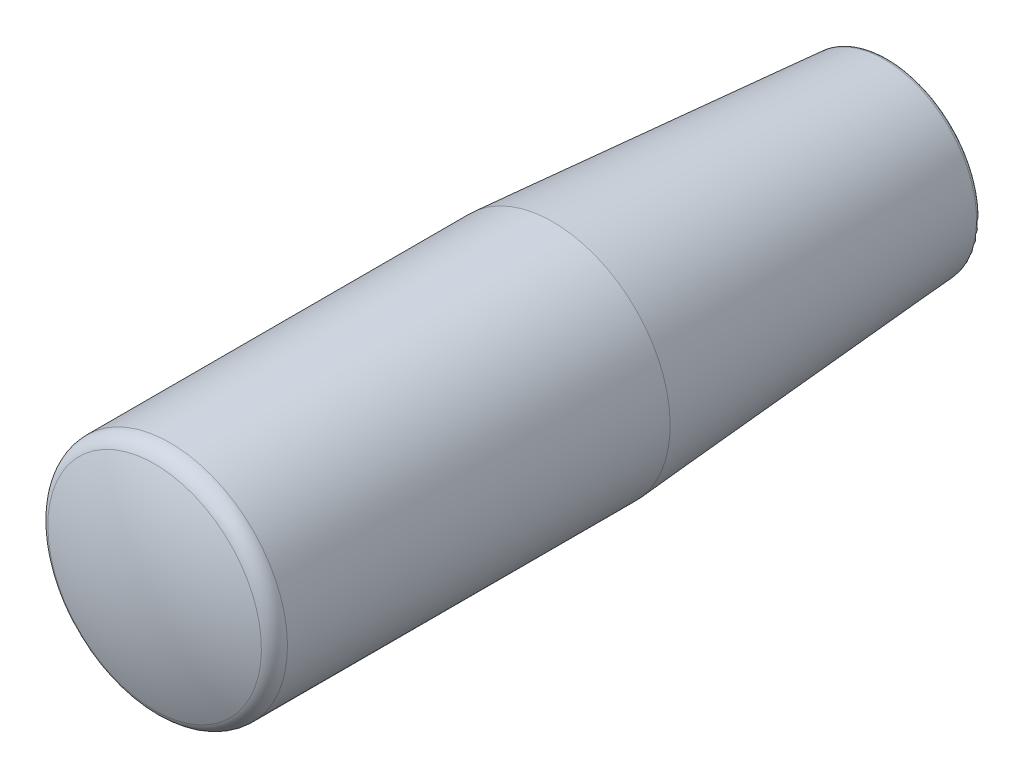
ISO-10303-21;
HEADER;
FILE_DESCRIPTION(('STEP AP214'),'2;1');
FILE_NAME('part.step','',(''),(''),'','','');
FILE_SCHEMA(('AUTOMOTIVE_DESIGN { 1 0 10303 214 1 1 1 1 }'));
ENDSEC;
DATA;
#1=APPLICATION_CONTEXT('core data for automotive mechanical design processes');
#2=APPLICATION_PROTOCOL_DEFINITION('international standard','automotive_design',2000,#1);
#3=PRODUCT_CONTEXT('',#1,'mechanical');
#4=PRODUCT('Part','Part','',(#3));
#5=PRODUCT_RELATED_PRODUCT_CATEGORY('part','',(#4));
#6=PRODUCT_DEFINITION_FORMATION('','',#4);
#7=PRODUCT_DEFINITION_CONTEXT('part definition',#1,'design');
#8=PRODUCT_DEFINITION('design','',#6,#7);
#9=PRODUCT_DEFINITION_SHAPE('','',#8);
#10=(LENGTH_UNIT() NAMED_UNIT(*) SI_UNIT(.MILLI.,.METRE.));
#11=(NAMED_UNIT(*) PLANE_ANGLE_UNIT() SI_UNIT($,.RADIAN.));
#12=(NAMED_UNIT(*) SI_UNIT($,.STERADIAN.) SOLID_ANGLE_UNIT());
#13=UNCERTAINTY_MEASURE_WITH_UNIT(LENGTH_MEASURE(1.E-05),#10,'distance_accuracy_value','');
#14=(GEOMETRIC_REPRESENTATION_CONTEXT(3) GLOBAL_UNCERTAINTY_ASSIGNED_CONTEXT((#13)) GLOBAL_UNIT_ASSIGNED_CONTEXT((#10,
#11,#12)) REPRESENTATION_CONTEXT('',''));
#15=CARTESIAN_POINT('',(0.,0.,0.));
#16=DIRECTION('',(0.,0.,1.));
#17=DIRECTION('',(1.,0.,0.));
#18=AXIS2_PLACEMENT_3D('',#15,#16,#17);
#19=CARTESIAN_POINT('',(0.,0.,0.500000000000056));
#20=DIRECTION('',(0.,0.,-1.));
#21=DIRECTION('',(0.,-1.,0.));
#22=AXIS2_PLACEMENT_3D('',#19,#20,#21);
#23=TOROIDAL_SURFACE('',#22,10.5360957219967,0.500000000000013);
#24=CARTESIAN_POINT('',(0.,0.,0.));
#25=DIRECTION('',(0.,0.,-1.));
#26=DIRECTION('',(0.,-1.,0.));
#27=AXIS2_PLACEMENT_3D('',#24,#25,#26);
#28=CIRCLE('',#27,10.5360957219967);
#29=CARTESIAN_POINT('',(0.,-10.5360957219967,0.));
#30=VERTEX_POINT('',#29);
#31=EDGE_CURVE('E8',#30,#30,#28,.T.);
#32=ORIENTED_EDGE('',*,*,#31,.F.);
#33=EDGE_LOOP('',(#32));
#34=FACE_BOUND('',#33,.T.);
#35=CARTESIAN_POINT('',(0.,0.,0.462605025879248));
#36=DIRECTION('',(0.,0.,-1.));
#37=DIRECTION('',(0.,-1.,0.));
#38=AXIS2_PLACEMENT_3D('',#35,#36,#37);
#39=CIRCLE('',#38,11.034695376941);
#40=CARTESIAN_POINT('',(0.,-11.034695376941,0.462605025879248));
#41=VERTEX_POINT('',#40);
#42=EDGE_CURVE('E37',#41,#41,#39,.T.);
#43=ORIENTED_EDGE('',*,*,#42,.T.);
#44=EDGE_LOOP('',(#43));
#45=FACE_BOUND('',#44,.T.);
#46=ADVANCED_FACE('F12',(#34,#45),#23,.T.);
#47=CARTESIAN_POINT('',(0.,7.5,0.));
#48=DIRECTION('',(0.,0.,-1.));
#49=DIRECTION('',(0.,-1.,0.));
#50=AXIS2_PLACEMENT_3D('',#47,#48,#49);
#51=PLANE('',#50);
#52=ORIENTED_EDGE('',*,*,#31,.T.);
#53=EDGE_LOOP('',(#52));
#54=FACE_BOUND('',#53,.T.);
#55=CARTESIAN_POINT('',(0.,0.,0.));
#56=DIRECTION('',(0.,0.,-1.));
#57=DIRECTION('',(0.,-1.,0.));
#58=AXIS2_PLACEMENT_3D('',#55,#56,#57);
#59=CIRCLE('',#58,7.5);
#60=CARTESIAN_POINT('',(0.,-7.50000000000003,0.));
#61=VERTEX_POINT('',#60);
#62=EDGE_CURVE('E18',#61,#61,#59,.T.);
#63=ORIENTED_EDGE('',*,*,#62,.F.);
#64=EDGE_LOOP('',(#63));
#65=FACE_BOUND('',#64,.T.);
#66=ADVANCED_FACE('F56',(#54,#65),#51,.T.);
#67=CARTESIAN_POINT('',(0.,0.,-5.));
#68=DIRECTION('',(0.,0.,-1.));
#69=DIRECTION('',(0.,-1.,0.));
#70=AXIS2_PLACEMENT_3D('',#67,#68,#69);
#71=CYLINDRICAL_SURFACE('',#70,7.5);
#72=CARTESIAN_POINT('',(0.,0.,60.));
#73=DIRECTION('',(0.,0.,-1.));
#74=DIRECTION('',(0.,-1.,0.));
#75=AXIS2_PLACEMENT_3D('',#72,#73,#74);
#76=CIRCLE('',#75,7.5);
#77=CARTESIAN_POINT('',(0.,-7.5,60.));
#78=VERTEX_POINT('',#77);
#79=EDGE_CURVE('E22',#78,#78,#76,.T.);
#80=ORIENTED_EDGE('',*,*,#79,.F.);
#81=EDGE_LOOP('',(#80));
#82=FACE_BOUND('',#81,.T.);
#83=ORIENTED_EDGE('',*,*,#62,.T.);
#84=EDGE_LOOP('',(#83));
#85=FACE_BOUND('',#84,.T.);
#86=ADVANCED_FACE('F62',(#82,#85),#71,.F.);
#87=CARTESIAN_POINT('',(0.,7.5,60.));
#88=DIRECTION('',(0.,0.,1.));
#89=DIRECTION('',(0.,1.,0.));
#90=AXIS2_PLACEMENT_3D('',#87,#88,#89);
#91=PLANE('',#90);
#92=ORIENTED_EDGE('',*,*,#79,.T.);
#93=EDGE_LOOP('',(#92));
#94=FACE_BOUND('',#93,.T.);
#95=ADVANCED_FACE('F67',(#94),#91,.F.);
#96=CARTESIAN_POINT('',(0.,0.,55.8333333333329));
#97=DIRECTION('',(-1.,0.,0.));
#98=DIRECTION('',(0.,0.,1.));
#99=AXIS2_PLACEMENT_3D('',#96,#97,#98);
#100=SPHERICAL_SURFACE('',#99,34.166666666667);
#101=CARTESIAN_POINT('',(0.,0.,55.8333333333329));
#102=DIRECTION('',(0.,0.,-1.));
#103=DIRECTION('',(0.,-1.,0.));
#104=AXIS2_PLACEMENT_3D('',#101,#102,#103);
#105=SPHERICAL_SURFACE('',#104,34.166666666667);
#106=CARTESIAN_POINT('',(0.,0.,87.5334546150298));
#107=DIRECTION('',(0.,0.,-1.));
#108=DIRECTION('',(0.,-1.,0.));
#109=AXIS2_PLACEMENT_3D('',#106,#107,#108);
#110=CIRCLE('',#109,12.7461139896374);
#111=CARTESIAN_POINT('',(0.,-12.7461139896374,87.5334546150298));
#112=VERTEX_POINT('',#111);
#113=EDGE_CURVE('E26',#112,#112,#110,.T.);
#114=ORIENTED_EDGE('',*,*,#113,.F.);
#115=EDGE_LOOP('',(#114));
#116=FACE_BOUND('',#115,.T.);
#117=ADVANCED_FACE('F74',(#116),#105,.T.);
#118=CARTESIAN_POINT('',(0.,0.,85.6778377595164));
#119=DIRECTION('',(0.,0.,-1.));
#120=DIRECTION('',(0.,-1.,0.));
#121=AXIS2_PLACEMENT_3D('',#118,#119,#120);
#122=TOROIDAL_SURFACE('',#121,12.,2.);
#123=CARTESIAN_POINT('',(0.,0.,85.6778377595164));
#124=DIRECTION('',(0.,0.,-1.));
#125=DIRECTION('',(0.,-1.,0.));
#126=AXIS2_PLACEMENT_3D('',#123,#124,#125);
#127=CIRCLE('',#126,14.);
#128=CARTESIAN_POINT('',(0.,-14.,85.6778377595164));
#129=VERTEX_POINT('',#128);
#130=EDGE_CURVE('E31',#129,#129,#127,.T.);
#131=ORIENTED_EDGE('',*,*,#130,.F.);
#132=EDGE_LOOP('',(#131));
#133=FACE_BOUND('',#132,.T.);
#134=ORIENTED_EDGE('',*,*,#113,.T.);
#135=EDGE_LOOP('',(#134));
#136=FACE_BOUND('',#135,.T.);
#137=ADVANCED_FACE('F52',(#133,#136),#122,.T.);
#138=CARTESIAN_POINT('',(0.,0.,-5.));
#139=DIRECTION('',(0.,0.,-1.));
#140=DIRECTION('',(0.,-1.,0.));
#141=AXIS2_PLACEMENT_3D('',#138,#139,#140);
#142=CYLINDRICAL_SURFACE('',#141,14.);
#143=ORIENTED_EDGE('',*,*,#130,.T.);
#144=EDGE_LOOP('',(#143));
#145=FACE_BOUND('',#144,.T.);
#146=CARTESIAN_POINT('',(0.,-1.38777878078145E-13,40.));
#147=DIRECTION('',(0.,0.,-1.));
#148=DIRECTION('',(0.,-1.,0.));
#149=AXIS2_PLACEMENT_3D('',#146,#147,#148);
#150=CIRCLE('',#149,14.);
#151=CARTESIAN_POINT('',(0.,-14.0000000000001,40.));
#152=VERTEX_POINT('',#151);
#153=EDGE_CURVE('E34',#152,#152,#150,.T.);
#154=ORIENTED_EDGE('',*,*,#153,.F.);
#155=EDGE_LOOP('',(#154));
#156=FACE_BOUND('',#155,.T.);
#157=ADVANCED_FACE('F44',(#145,#156),#142,.T.);
#158=CARTESIAN_POINT('',(0.,0.,0.462605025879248));
#159=DIRECTION('',(0.,0.,1.));
#160=DIRECTION('',(0.,1.,0.));
#161=AXIS2_PLACEMENT_3D('',#158,#159,#160);
#162=CONICAL_SURFACE('',#161,11.034695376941,0.0748598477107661);
#163=ORIENTED_EDGE('',*,*,#153,.T.);
#164=EDGE_LOOP('',(#163));
#165=FACE_BOUND('',#164,.T.);
#166=ORIENTED_EDGE('',*,*,#42,.F.);
#167=EDGE_LOOP('',(#166));
#168=FACE_BOUND('',#167,.T.);
#169=ADVANCED_FACE('F42',(#165,#168),#162,.T.);
#170=CLOSED_SHELL('',(#46,#66,#86,#95,#117,#137,#157,#169));
#171=MANIFOLD_SOLID_BREP('B1',#170);
#172=ADVANCED_BREP_SHAPE_REPRESENTATION('',(#18,#171),#14);
#173=SHAPE_DEFINITION_REPRESENTATION(#9,#172);
ENDSEC;
END-ISO-10303-21;
